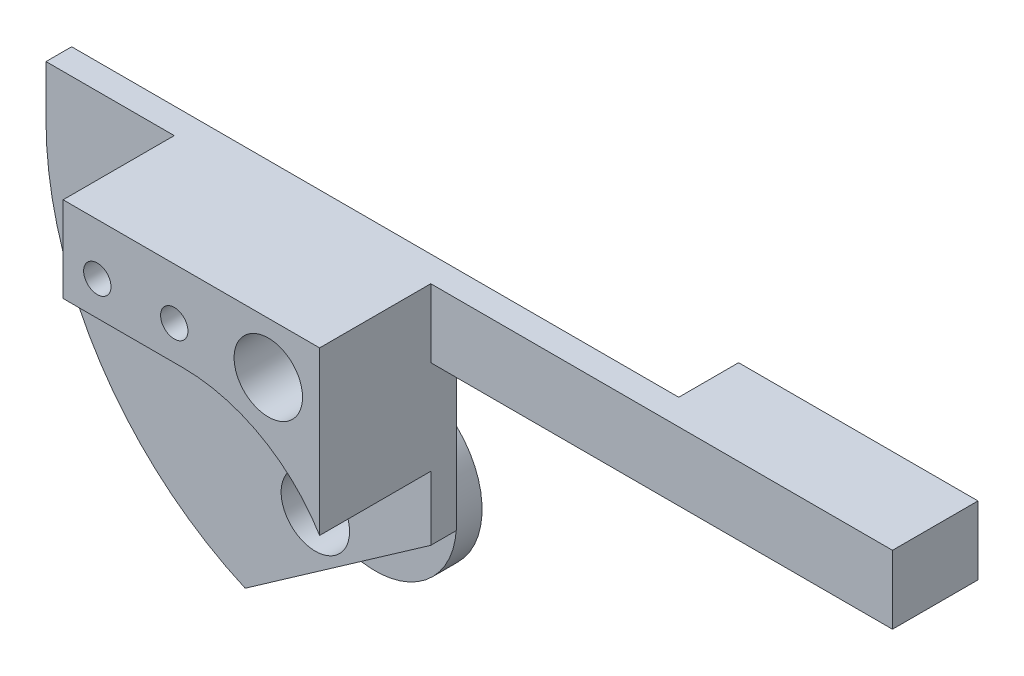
from build123d import *

# Parameters (mm, degrees)
ESQUISSE1_R             = 2
BOSS_EXTRU_1_DEPTH      = 1.5
ESQUISSE2_R             = 2
BOSS_EXTRU_2_DEPTH      = 6.5
ESQUISSE3_W             = 14
ESQUISSE3_H             = 4
BOSS_EXTRU_3_DEPTH      = 3.5
ESQUISSE4_R             = 2
ENL_V_MAT_EXTRU_1_DEPTH = 3
ESQUISSE5_R             = 4.75
ESQUISSE5_R_2           = 2
BOSS_EXTRU_4_DEPTH      = 3.5
ENL_V_START             = -3.5
ESQUISSE6_R             = 2
ENL_V_MAT_EXTRU_2_DEPTH = 3.5
TROU_TARAUD_M21_D       = 1.6
TROU_TARAUD_M21_DEPTH   = 4
TROU_TARAUD_M21_TIP     = 0.480688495
ENL_V_MAT_EXTRU_3_DEPTH = 3.5


with BuildPart() as part:
    # Esquisse1 → Boss.-Extru.1 (new body)
    with BuildSketch(Plane.XY):
        with BuildLine():
            Line((15.5, 68), (15.5, 71))
            Line((15.5, 71), (65, 71))
            Line((65, 71), (65, 67))
            Line((65, 67), (38, 67))
            Line((38, 67), (38, 48.732151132))
            ThreePointArc((38, 48.732151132), (22.316349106, 53.188686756), (15.5, 68))
        make_face()
        with Locations((35, 68)):
            Circle(ESQUISSE1_R, mode=Mode.SUBTRACT)
    extrude(amount=BOSS_EXTRU_1_DEPTH)

    # Esquisse2 → Boss.-Extru.2 (add)
    with BuildSketch(Plane.XY.offset(1.5)):
        with BuildLine():
            Line((23, 71), (38, 71))
            Line((38, 71), (38, 61.5))
            ThreePointArc((38, 61.5), (34.589389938, 64.797804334), (30, 66))
            Line((30, 66), (23, 66))
            Line((23, 66), (23, 71))
        make_face()
        with Locations((35, 68)):
            Circle(ESQUISSE2_R, mode=Mode.SUBTRACT)
    extrude(amount=BOSS_EXTRU_2_DEPTH)

    # Esquisse3 → Boss.-Extru.3 (add)
    with BuildSketch(Plane(origin=(0, 0, 0), x_dir=(-1, 0, 0), z_dir=(0, 0, -1))):
        with Locations((-58, 69)):
            Rectangle(ESQUISSE3_W, ESQUISSE3_H)
    extrude(amount=BOSS_EXTRU_3_DEPTH)

    # Esquisse4 → Enl_v. mat.-Extru.1 (cut)
    with BuildSketch(Plane.XZ.offset(-67)):
        with Locations(Location((58, -1, 0), (0, 0, 270))):
            Circle(ESQUISSE4_R)
    extrude(amount=-ENL_V_MAT_EXTRU_1_DEPTH, mode=Mode.SUBTRACT)

    # Esquisse5 → Boss.-Extru.4 (add)
    with BuildSketch(Plane(origin=(0, 0, 0), x_dir=(-1, 0, 0), z_dir=(0, 0, -1))):
        with Locations(Location((-31.25, 56.075759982, 0), (0, 0, 180))):
            Circle(ESQUISSE5_R)
        with Locations((-31.25, 56.075759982)):
            Circle(ESQUISSE5_R_2, mode=Mode.SUBTRACT)
    extrude(amount=BOSS_EXTRU_4_DEPTH)

    # Esquisse6 → Enl_v. mat.-Extru.2 (cut)
    with BuildSketch(Plane(origin=(0, 0, 0), x_dir=(-1, 0, 0), z_dir=(0, 0, -1)).offset(ENL_V_START)):
        with Locations(Location((-31.25, 56.075759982, 0), (0, 0, 180))):
            Circle(ESQUISSE6_R)
    extrude(amount=ENL_V_MAT_EXTRU_2_DEPTH, mode=Mode.SUBTRACT)

    # Trou taraud_ M21
    with Locations(Plane.XY.offset(8)):
        with Locations((25, 68), (29.5, 68)):
            Hole(TROU_TARAUD_M21_D / 2, depth=TROU_TARAUD_M21_DEPTH)
            with Locations((0, 0, -(TROU_TARAUD_M21_DEPTH + TROU_TARAUD_M21_TIP / 2))):  # 118° drill point
                Cone(0, TROU_TARAUD_M21_D / 2, TROU_TARAUD_M21_TIP, mode=Mode.SUBTRACT)

    # Esquisse9 → Enl_v. mat.-Extru.3 (cut)
    with BuildSketch(Plane.XY.offset(1.5)):
        Polygon((38, 57.750224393), (23.900386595, 47.877568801), (38, 47.877568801), align=None)
    extrude(amount=-ENL_V_MAT_EXTRU_3_DEPTH, mode=Mode.SUBTRACT)


solid = part.part
